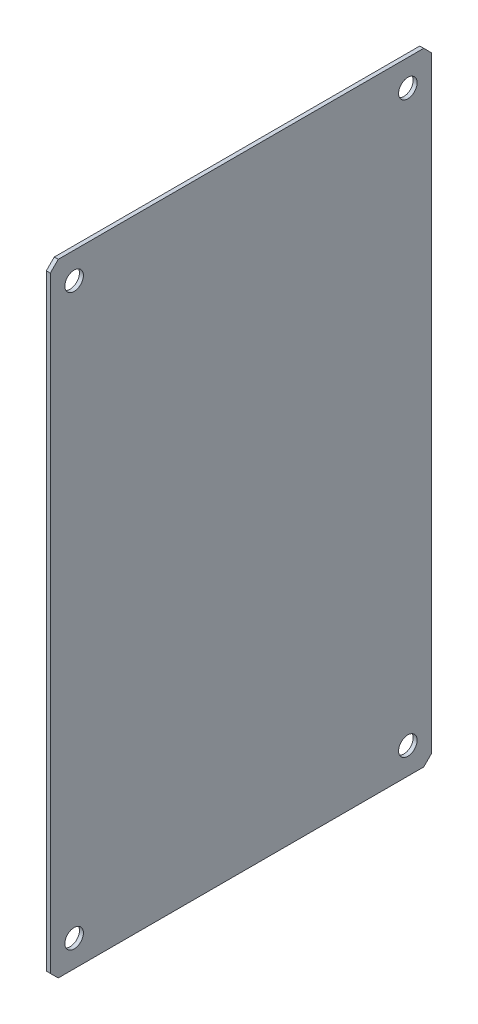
ISO-10303-21;
HEADER;
FILE_DESCRIPTION(('STEP AP214'),'2;1');
FILE_NAME('part.step','',(''),(''),'','','');
FILE_SCHEMA(('AUTOMOTIVE_DESIGN { 1 0 10303 214 1 1 1 1 }'));
ENDSEC;
DATA;
#1=APPLICATION_CONTEXT('core data for automotive mechanical design processes');
#2=APPLICATION_PROTOCOL_DEFINITION('international standard','automotive_design',2000,#1);
#3=PRODUCT_CONTEXT('',#1,'mechanical');
#4=PRODUCT('Part','Part','',(#3));
#5=PRODUCT_RELATED_PRODUCT_CATEGORY('part','',(#4));
#6=PRODUCT_DEFINITION_FORMATION('','',#4);
#7=PRODUCT_DEFINITION_CONTEXT('part definition',#1,'design');
#8=PRODUCT_DEFINITION('design','',#6,#7);
#9=PRODUCT_DEFINITION_SHAPE('','',#8);
#10=(LENGTH_UNIT() NAMED_UNIT(*) SI_UNIT(.MILLI.,.METRE.));
#11=(NAMED_UNIT(*) PLANE_ANGLE_UNIT() SI_UNIT($,.RADIAN.));
#12=(NAMED_UNIT(*) SI_UNIT($,.STERADIAN.) SOLID_ANGLE_UNIT());
#13=UNCERTAINTY_MEASURE_WITH_UNIT(LENGTH_MEASURE(1.E-05),#10,'distance_accuracy_value','');
#14=(GEOMETRIC_REPRESENTATION_CONTEXT(3) GLOBAL_UNCERTAINTY_ASSIGNED_CONTEXT((#13)) GLOBAL_UNIT_ASSIGNED_CONTEXT((#10,
#11,#12)) REPRESENTATION_CONTEXT('',''));
#15=CARTESIAN_POINT('',(0.,0.,0.));
#16=DIRECTION('',(0.,0.,1.));
#17=DIRECTION('',(1.,0.,0.));
#18=AXIS2_PLACEMENT_3D('',#15,#16,#17);
#19=CARTESIAN_POINT('',(1.49999999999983,-117.5,72.));
#20=DIRECTION('',(0.,0.,-1.));
#21=DIRECTION('',(0.,1.,0.));
#22=AXIS2_PLACEMENT_3D('',#19,#20,#21);
#23=PLANE('',#22);
#24=DIRECTION('',(0.,-1.,0.));
#25=VECTOR('',#24,1.);
#26=CARTESIAN_POINT('',(1.49999999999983,-117.5,72.));
#27=LINE('',#26,#25);
#28=CARTESIAN_POINT('',(1.49999999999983,114.5,72.));
#29=VERTEX_POINT('',#28);
#30=CARTESIAN_POINT('',(1.49999999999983,-114.5,72.));
#31=VERTEX_POINT('',#30);
#32=EDGE_CURVE('E99',#29,#31,#27,.T.);
#33=ORIENTED_EDGE('',*,*,#32,.F.);
#34=DIRECTION('',(-1.,0.,0.));
#35=VECTOR('',#34,1.);
#36=CARTESIAN_POINT('',(1.49999999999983,114.5,72.));
#37=LINE('',#36,#35);
#38=CARTESIAN_POINT('',(0.,114.5,72.));
#39=VERTEX_POINT('',#38);
#40=EDGE_CURVE('E84',#29,#39,#37,.T.);
#41=ORIENTED_EDGE('',*,*,#40,.T.);
#42=DIRECTION('',(0.,-1.,0.));
#43=VECTOR('',#42,1.);
#44=CARTESIAN_POINT('',(0.,-117.5,72.));
#45=LINE('',#44,#43);
#46=CARTESIAN_POINT('',(0.,-114.5,72.));
#47=VERTEX_POINT('',#46);
#48=EDGE_CURVE('E96',#39,#47,#45,.T.);
#49=ORIENTED_EDGE('',*,*,#48,.T.);
#50=DIRECTION('',(1.,0.,0.));
#51=VECTOR('',#50,1.);
#52=CARTESIAN_POINT('',(1.49999999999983,-114.5,72.));
#53=LINE('',#52,#51);
#54=EDGE_CURVE('E101',#47,#31,#53,.T.);
#55=ORIENTED_EDGE('',*,*,#54,.T.);
#56=EDGE_LOOP('',(#33,#41,#49,#55));
#57=FACE_BOUND('',#56,.T.);
#58=ADVANCED_FACE('F15',(#57),#23,.F.);
#59=CARTESIAN_POINT('',(1.49999999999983,-117.5,72.));
#60=DIRECTION('',(0.,1.,0.));
#61=DIRECTION('',(0.,0.,1.));
#62=AXIS2_PLACEMENT_3D('',#59,#60,#61);
#63=PLANE('',#62);
#64=DIRECTION('',(0.,0.,-1.));
#65=VECTOR('',#64,1.);
#66=CARTESIAN_POINT('',(0.,-117.5,72.));
#67=LINE('',#66,#65);
#68=CARTESIAN_POINT('',(0.,-117.5,69.));
#69=VERTEX_POINT('',#68);
#70=CARTESIAN_POINT('',(0.,-117.5,-69.));
#71=VERTEX_POINT('',#70);
#72=EDGE_CURVE('E105',#69,#71,#67,.T.);
#73=ORIENTED_EDGE('',*,*,#72,.T.);
#74=DIRECTION('',(1.,0.,0.));
#75=VECTOR('',#74,1.);
#76=CARTESIAN_POINT('',(1.49999999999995,-117.5,-69.));
#77=LINE('',#76,#75);
#78=CARTESIAN_POINT('',(1.49999999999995,-117.5,-69.));
#79=VERTEX_POINT('',#78);
#80=EDGE_CURVE('E10',#71,#79,#77,.T.);
#81=ORIENTED_EDGE('',*,*,#80,.T.);
#82=DIRECTION('',(0.,0.,-1.));
#83=VECTOR('',#82,1.);
#84=CARTESIAN_POINT('',(1.49999999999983,-117.5,72.));
#85=LINE('',#84,#83);
#86=CARTESIAN_POINT('',(1.49999999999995,-117.5,69.));
#87=VERTEX_POINT('',#86);
#88=EDGE_CURVE('E120',#87,#79,#85,.T.);
#89=ORIENTED_EDGE('',*,*,#88,.F.);
#90=DIRECTION('',(-1.,0.,0.));
#91=VECTOR('',#90,1.);
#92=CARTESIAN_POINT('',(1.49999999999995,-117.5,69.));
#93=LINE('',#92,#91);
#94=EDGE_CURVE('E22',#87,#69,#93,.T.);
#95=ORIENTED_EDGE('',*,*,#94,.T.);
#96=EDGE_LOOP('',(#73,#81,#89,#95));
#97=FACE_BOUND('',#96,.T.);
#98=ADVANCED_FACE('F149',(#97),#63,.F.);
#99=CARTESIAN_POINT('',(1.49999999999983,-117.5,-72.));
#100=DIRECTION('',(0.,0.,1.));
#101=DIRECTION('',(0.,-1.,0.));
#102=AXIS2_PLACEMENT_3D('',#99,#100,#101);
#103=PLANE('',#102);
#104=DIRECTION('',(0.,1.,0.));
#105=VECTOR('',#104,1.);
#106=CARTESIAN_POINT('',(0.,-117.5,-72.));
#107=LINE('',#106,#105);
#108=CARTESIAN_POINT('',(0.,-114.5,-72.));
#109=VERTEX_POINT('',#108);
#110=CARTESIAN_POINT('',(0.,114.5,-72.));
#111=VERTEX_POINT('',#110);
#112=EDGE_CURVE('E109',#109,#111,#107,.T.);
#113=ORIENTED_EDGE('',*,*,#112,.T.);
#114=DIRECTION('',(1.,0.,0.));
#115=VECTOR('',#114,1.);
#116=CARTESIAN_POINT('',(1.49999999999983,114.5,-72.));
#117=LINE('',#116,#115);
#118=CARTESIAN_POINT('',(1.49999999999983,114.5,-72.));
#119=VERTEX_POINT('',#118);
#120=EDGE_CURVE('E29',#111,#119,#117,.T.);
#121=ORIENTED_EDGE('',*,*,#120,.T.);
#122=DIRECTION('',(0.,1.,0.));
#123=VECTOR('',#122,1.);
#124=CARTESIAN_POINT('',(1.49999999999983,-117.5,-72.));
#125=LINE('',#124,#123);
#126=CARTESIAN_POINT('',(1.49999999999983,-114.5,-72.));
#127=VERTEX_POINT('',#126);
#128=EDGE_CURVE('E122',#127,#119,#125,.T.);
#129=ORIENTED_EDGE('',*,*,#128,.F.);
#130=DIRECTION('',(-1.,0.,0.));
#131=VECTOR('',#130,1.);
#132=CARTESIAN_POINT('',(1.49999999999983,-114.5,-72.));
#133=LINE('',#132,#131);
#134=EDGE_CURVE('E142',#127,#109,#133,.T.);
#135=ORIENTED_EDGE('',*,*,#134,.T.);
#136=EDGE_LOOP('',(#113,#121,#129,#135));
#137=FACE_BOUND('',#136,.T.);
#138=ADVANCED_FACE('F157',(#137),#103,.F.);
#139=CARTESIAN_POINT('',(1.49999999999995,117.5,72.));
#140=DIRECTION('',(0.,-1.,0.));
#141=DIRECTION('',(0.,0.,-1.));
#142=AXIS2_PLACEMENT_3D('',#139,#140,#141);
#143=PLANE('',#142);
#144=DIRECTION('',(0.,0.,1.));
#145=VECTOR('',#144,1.);
#146=CARTESIAN_POINT('',(0.,117.5,72.));
#147=LINE('',#146,#145);
#148=CARTESIAN_POINT('',(0.,117.5,-69.));
#149=VERTEX_POINT('',#148);
#150=CARTESIAN_POINT('',(0.,117.5,69.));
#151=VERTEX_POINT('',#150);
#152=EDGE_CURVE('E117',#149,#151,#147,.T.);
#153=ORIENTED_EDGE('',*,*,#152,.T.);
#154=DIRECTION('',(1.,0.,0.));
#155=VECTOR('',#154,1.);
#156=CARTESIAN_POINT('',(1.49999999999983,117.5,69.));
#157=LINE('',#156,#155);
#158=CARTESIAN_POINT('',(1.49999999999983,117.5,69.));
#159=VERTEX_POINT('',#158);
#160=EDGE_CURVE('E85',#151,#159,#157,.T.);
#161=ORIENTED_EDGE('',*,*,#160,.T.);
#162=DIRECTION('',(0.,0.,1.));
#163=VECTOR('',#162,1.);
#164=CARTESIAN_POINT('',(1.49999999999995,117.5,72.));
#165=LINE('',#164,#163);
#166=CARTESIAN_POINT('',(1.49999999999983,117.5,-69.));
#167=VERTEX_POINT('',#166);
#168=EDGE_CURVE('E124',#167,#159,#165,.T.);
#169=ORIENTED_EDGE('',*,*,#168,.F.);
#170=DIRECTION('',(-1.,0.,0.));
#171=VECTOR('',#170,1.);
#172=CARTESIAN_POINT('',(1.49999999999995,117.5,-69.));
#173=LINE('',#172,#171);
#174=EDGE_CURVE('E90',#167,#149,#173,.T.);
#175=ORIENTED_EDGE('',*,*,#174,.T.);
#176=EDGE_LOOP('',(#153,#161,#169,#175));
#177=FACE_BOUND('',#176,.T.);
#178=ADVANCED_FACE('F165',(#177),#143,.F.);
#179=CARTESIAN_POINT('',(1.49999999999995,117.5,72.));
#180=DIRECTION('',(-1.,0.,0.));
#181=DIRECTION('',(0.,0.,1.));
#182=AXIS2_PLACEMENT_3D('',#179,#180,#181);
#183=PLANE('',#182);
#184=CARTESIAN_POINT('',(1.49999999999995,107.5,-63.));
#185=DIRECTION('',(-1.,0.,0.));
#186=DIRECTION('',(0.,0.,1.));
#187=AXIS2_PLACEMENT_3D('',#184,#185,#186);
#188=CIRCLE('',#187,3.5);
#189=CARTESIAN_POINT('',(1.49999999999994,107.5,-59.5));
#190=VERTEX_POINT('',#189);
#191=EDGE_CURVE('E268',#190,#190,#188,.T.);
#192=ORIENTED_EDGE('',*,*,#191,.T.);
#193=EDGE_LOOP('',(#192));
#194=FACE_BOUND('',#193,.T.);
#195=CARTESIAN_POINT('',(1.49999999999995,-107.5,-63.));
#196=DIRECTION('',(-1.,0.,0.));
#197=DIRECTION('',(0.,0.,1.));
#198=AXIS2_PLACEMENT_3D('',#195,#196,#197);
#199=CIRCLE('',#198,3.5);
#200=CARTESIAN_POINT('',(1.49999999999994,-107.5,-59.5));
#201=VERTEX_POINT('',#200);
#202=EDGE_CURVE('E278',#201,#201,#199,.T.);
#203=ORIENTED_EDGE('',*,*,#202,.T.);
#204=EDGE_LOOP('',(#203));
#205=FACE_BOUND('',#204,.T.);
#206=CARTESIAN_POINT('',(1.49999999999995,-107.5,63.));
#207=DIRECTION('',(-1.,0.,0.));
#208=DIRECTION('',(0.,0.,1.));
#209=AXIS2_PLACEMENT_3D('',#206,#207,#208);
#210=CIRCLE('',#209,3.5);
#211=CARTESIAN_POINT('',(1.49999999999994,-107.5,66.5));
#212=VERTEX_POINT('',#211);
#213=EDGE_CURVE('E284',#212,#212,#210,.T.);
#214=ORIENTED_EDGE('',*,*,#213,.T.);
#215=EDGE_LOOP('',(#214));
#216=FACE_BOUND('',#215,.T.);
#217=CARTESIAN_POINT('',(1.49999999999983,107.5,63.));
#218=DIRECTION('',(-1.,0.,0.));
#219=DIRECTION('',(0.,0.,1.));
#220=AXIS2_PLACEMENT_3D('',#217,#218,#219);
#221=CIRCLE('',#220,3.5);
#222=CARTESIAN_POINT('',(1.49999999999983,107.5,66.5));
#223=VERTEX_POINT('',#222);
#224=EDGE_CURVE('E106',#223,#223,#221,.T.);
#225=ORIENTED_EDGE('',*,*,#224,.T.);
#226=EDGE_LOOP('',(#225));
#227=FACE_BOUND('',#226,.T.);
#228=ORIENTED_EDGE('',*,*,#168,.T.);
#229=DIRECTION('',(0.,0.707106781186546,-0.707106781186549));
#230=VECTOR('',#229,1.);
#231=CARTESIAN_POINT('',(1.49999999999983,114.5,72.));
#232=LINE('',#231,#230);
#233=EDGE_CURVE('E140',#159,#29,#232,.F.);
#234=ORIENTED_EDGE('',*,*,#233,.T.);
#235=ORIENTED_EDGE('',*,*,#32,.T.);
#236=DIRECTION('',(0.,0.707106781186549,0.707106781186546));
#237=VECTOR('',#236,1.);
#238=CARTESIAN_POINT('',(1.49999999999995,-117.5,69.));
#239=LINE('',#238,#237);
#240=EDGE_CURVE('E135',#31,#87,#239,.F.);
#241=ORIENTED_EDGE('',*,*,#240,.T.);
#242=ORIENTED_EDGE('',*,*,#88,.T.);
#243=DIRECTION('',(0.,-0.707106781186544,0.707106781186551));
#244=VECTOR('',#243,1.);
#245=CARTESIAN_POINT('',(1.49999999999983,-114.5,-72.));
#246=LINE('',#245,#244);
#247=EDGE_CURVE('E36',#79,#127,#246,.F.);
#248=ORIENTED_EDGE('',*,*,#247,.T.);
#249=ORIENTED_EDGE('',*,*,#128,.T.);
#250=DIRECTION('',(0.,-0.707106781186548,-0.707106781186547));
#251=VECTOR('',#250,1.);
#252=CARTESIAN_POINT('',(1.49999999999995,117.5,-69.));
#253=LINE('',#252,#251);
#254=EDGE_CURVE('E138',#119,#167,#253,.F.);
#255=ORIENTED_EDGE('',*,*,#254,.T.);
#256=EDGE_LOOP('',(#228,#234,#235,#241,#242,#248,#249,#255));
#257=FACE_BOUND('',#256,.T.);
#258=ADVANCED_FACE('F159',(#194,#205,#216,#227,#257),#183,.F.);
#259=CARTESIAN_POINT('',(0.,117.5,72.));
#260=DIRECTION('',(-1.,0.,0.));
#261=DIRECTION('',(0.,0.,1.));
#262=AXIS2_PLACEMENT_3D('',#259,#260,#261);
#263=PLANE('',#262);
#264=CARTESIAN_POINT('',(0.,107.5,-63.));
#265=DIRECTION('',(-1.,0.,0.));
#266=DIRECTION('',(0.,0.,1.));
#267=AXIS2_PLACEMENT_3D('',#264,#265,#266);
#268=CIRCLE('',#267,3.5);
#269=CARTESIAN_POINT('',(0.,107.5,-59.5));
#270=VERTEX_POINT('',#269);
#271=EDGE_CURVE('E271',#270,#270,#268,.T.);
#272=ORIENTED_EDGE('',*,*,#271,.F.);
#273=EDGE_LOOP('',(#272));
#274=FACE_BOUND('',#273,.T.);
#275=CARTESIAN_POINT('',(0.,-107.5,-63.));
#276=DIRECTION('',(-1.,0.,0.));
#277=DIRECTION('',(0.,0.,1.));
#278=AXIS2_PLACEMENT_3D('',#275,#276,#277);
#279=CIRCLE('',#278,3.5);
#280=CARTESIAN_POINT('',(0.,-107.5,-59.5));
#281=VERTEX_POINT('',#280);
#282=EDGE_CURVE('E273',#281,#281,#279,.T.);
#283=ORIENTED_EDGE('',*,*,#282,.F.);
#284=EDGE_LOOP('',(#283));
#285=FACE_BOUND('',#284,.T.);
#286=CARTESIAN_POINT('',(0.,-107.5,63.));
#287=DIRECTION('',(-1.,0.,0.));
#288=DIRECTION('',(0.,0.,1.));
#289=AXIS2_PLACEMENT_3D('',#286,#287,#288);
#290=CIRCLE('',#289,3.5);
#291=CARTESIAN_POINT('',(0.,-107.5,66.5));
#292=VERTEX_POINT('',#291);
#293=EDGE_CURVE('E281',#292,#292,#290,.T.);
#294=ORIENTED_EDGE('',*,*,#293,.F.);
#295=EDGE_LOOP('',(#294));
#296=FACE_BOUND('',#295,.T.);
#297=CARTESIAN_POINT('',(0.,107.5,63.));
#298=DIRECTION('',(-1.,0.,0.));
#299=DIRECTION('',(0.,0.,1.));
#300=AXIS2_PLACEMENT_3D('',#297,#298,#299);
#301=CIRCLE('',#300,3.5);
#302=CARTESIAN_POINT('',(0.,107.5,66.5));
#303=VERTEX_POINT('',#302);
#304=EDGE_CURVE('E112',#303,#303,#301,.T.);
#305=ORIENTED_EDGE('',*,*,#304,.F.);
#306=EDGE_LOOP('',(#305));
#307=FACE_BOUND('',#306,.T.);
#308=ORIENTED_EDGE('',*,*,#48,.F.);
#309=DIRECTION('',(0.,-0.707106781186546,0.707106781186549));
#310=VECTOR('',#309,1.);
#311=CARTESIAN_POINT('',(0.,116.,70.5));
#312=LINE('',#311,#310);
#313=EDGE_CURVE('E80',#39,#151,#312,.F.);
#314=ORIENTED_EDGE('',*,*,#313,.T.);
#315=ORIENTED_EDGE('',*,*,#152,.F.);
#316=DIRECTION('',(0.,0.707106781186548,0.707106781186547));
#317=VECTOR('',#316,1.);
#318=CARTESIAN_POINT('',(0.,188.,1.5));
#319=LINE('',#318,#317);
#320=EDGE_CURVE('E91',#149,#111,#319,.F.);
#321=ORIENTED_EDGE('',*,*,#320,.T.);
#322=ORIENTED_EDGE('',*,*,#112,.F.);
#323=DIRECTION('',(0.,0.707106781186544,-0.707106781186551));
#324=VECTOR('',#323,1.);
#325=CARTESIAN_POINT('',(0.,-70.5000000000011,-116.));
#326=LINE('',#325,#324);
#327=EDGE_CURVE('E129',#109,#71,#326,.F.);
#328=ORIENTED_EDGE('',*,*,#327,.T.);
#329=ORIENTED_EDGE('',*,*,#72,.F.);
#330=DIRECTION('',(0.,-0.707106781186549,-0.707106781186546));
#331=VECTOR('',#330,1.);
#332=CARTESIAN_POINT('',(-2.22044604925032E-13,1.50000000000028,188.));
#333=LINE('',#332,#331);
#334=EDGE_CURVE('E100',#69,#47,#333,.F.);
#335=ORIENTED_EDGE('',*,*,#334,.T.);
#336=EDGE_LOOP('',(#308,#314,#315,#321,#322,#328,#329,#335));
#337=FACE_BOUND('',#336,.T.);
#338=ADVANCED_FACE('F103',(#274,#285,#296,#307,#337),#263,.T.);
#339=CARTESIAN_POINT('',(0.,107.5,63.));
#340=DIRECTION('',(-1.,0.,0.));
#341=DIRECTION('',(0.,0.,1.));
#342=AXIS2_PLACEMENT_3D('',#339,#340,#341);
#343=CYLINDRICAL_SURFACE('',#342,3.5);
#344=ORIENTED_EDGE('',*,*,#224,.F.);
#345=EDGE_LOOP('',(#344));
#346=FACE_BOUND('',#345,.T.);
#347=ORIENTED_EDGE('',*,*,#304,.T.);
#348=EDGE_LOOP('',(#347));
#349=FACE_BOUND('',#348,.T.);
#350=ADVANCED_FACE('F190',(#346,#349),#343,.F.);
#351=CARTESIAN_POINT('',(0.,-107.5,63.));
#352=DIRECTION('',(-1.,0.,0.));
#353=DIRECTION('',(0.,0.,1.));
#354=AXIS2_PLACEMENT_3D('',#351,#352,#353);
#355=CYLINDRICAL_SURFACE('',#354,3.5);
#356=ORIENTED_EDGE('',*,*,#213,.F.);
#357=EDGE_LOOP('',(#356));
#358=FACE_BOUND('',#357,.T.);
#359=ORIENTED_EDGE('',*,*,#293,.T.);
#360=EDGE_LOOP('',(#359));
#361=FACE_BOUND('',#360,.T.);
#362=ADVANCED_FACE('F194',(#358,#361),#355,.F.);
#363=CARTESIAN_POINT('',(0.,-107.5,-63.));
#364=DIRECTION('',(-1.,0.,0.));
#365=DIRECTION('',(0.,0.,1.));
#366=AXIS2_PLACEMENT_3D('',#363,#364,#365);
#367=CYLINDRICAL_SURFACE('',#366,3.5);
#368=ORIENTED_EDGE('',*,*,#202,.F.);
#369=EDGE_LOOP('',(#368));
#370=FACE_BOUND('',#369,.T.);
#371=ORIENTED_EDGE('',*,*,#282,.T.);
#372=EDGE_LOOP('',(#371));
#373=FACE_BOUND('',#372,.T.);
#374=ADVANCED_FACE('F198',(#370,#373),#367,.F.);
#375=CARTESIAN_POINT('',(0.,107.5,-63.));
#376=DIRECTION('',(-1.,0.,0.));
#377=DIRECTION('',(0.,0.,1.));
#378=AXIS2_PLACEMENT_3D('',#375,#376,#377);
#379=CYLINDRICAL_SURFACE('',#378,3.5);
#380=ORIENTED_EDGE('',*,*,#191,.F.);
#381=EDGE_LOOP('',(#380));
#382=FACE_BOUND('',#381,.T.);
#383=ORIENTED_EDGE('',*,*,#271,.T.);
#384=EDGE_LOOP('',(#383));
#385=FACE_BOUND('',#384,.T.);
#386=ADVANCED_FACE('F202',(#382,#385),#379,.F.);
#387=CARTESIAN_POINT('',(1.49999999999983,114.5,72.));
#388=DIRECTION('',(0.,-0.707106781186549,-0.707106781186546));
#389=DIRECTION('',(0.,0.707106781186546,-0.707106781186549));
#390=AXIS2_PLACEMENT_3D('',#387,#388,#389);
#391=PLANE('',#390);
#392=ORIENTED_EDGE('',*,*,#233,.F.);
#393=ORIENTED_EDGE('',*,*,#160,.F.);
#394=ORIENTED_EDGE('',*,*,#313,.F.);
#395=ORIENTED_EDGE('',*,*,#40,.F.);
#396=EDGE_LOOP('',(#392,#393,#394,#395));
#397=FACE_BOUND('',#396,.T.);
#398=ADVANCED_FACE('F83',(#397),#391,.F.);
#399=CARTESIAN_POINT('',(1.49999999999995,117.5,-69.));
#400=DIRECTION('',(0.,-0.707106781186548,0.707106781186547));
#401=DIRECTION('',(0.,-0.707106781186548,-0.707106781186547));
#402=AXIS2_PLACEMENT_3D('',#399,#400,#401);
#403=PLANE('',#402);
#404=ORIENTED_EDGE('',*,*,#254,.F.);
#405=ORIENTED_EDGE('',*,*,#120,.F.);
#406=ORIENTED_EDGE('',*,*,#320,.F.);
#407=ORIENTED_EDGE('',*,*,#174,.F.);
#408=EDGE_LOOP('',(#404,#405,#406,#407));
#409=FACE_BOUND('',#408,.T.);
#410=ADVANCED_FACE('F163',(#409),#403,.F.);
#411=CARTESIAN_POINT('',(1.49999999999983,-114.5,-72.));
#412=DIRECTION('',(0.,0.707106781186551,0.707106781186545));
#413=DIRECTION('',(0.,-0.707106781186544,0.707106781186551));
#414=AXIS2_PLACEMENT_3D('',#411,#412,#413);
#415=PLANE('',#414);
#416=ORIENTED_EDGE('',*,*,#247,.F.);
#417=ORIENTED_EDGE('',*,*,#80,.F.);
#418=ORIENTED_EDGE('',*,*,#327,.F.);
#419=ORIENTED_EDGE('',*,*,#134,.F.);
#420=EDGE_LOOP('',(#416,#417,#418,#419));
#421=FACE_BOUND('',#420,.T.);
#422=ADVANCED_FACE('F156',(#421),#415,.F.);
#423=CARTESIAN_POINT('',(1.49999999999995,-117.5,69.));
#424=DIRECTION('',(0.,0.707106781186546,-0.707106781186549));
#425=DIRECTION('',(0.,0.707106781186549,0.707106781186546));
#426=AXIS2_PLACEMENT_3D('',#423,#424,#425);
#427=PLANE('',#426);
#428=ORIENTED_EDGE('',*,*,#240,.F.);
#429=ORIENTED_EDGE('',*,*,#54,.F.);
#430=ORIENTED_EDGE('',*,*,#334,.F.);
#431=ORIENTED_EDGE('',*,*,#94,.F.);
#432=EDGE_LOOP('',(#428,#429,#430,#431));
#433=FACE_BOUND('',#432,.T.);
#434=ADVANCED_FACE('F166',(#433),#427,.F.);
#435=CLOSED_SHELL('',(#58,#98,#138,#178,#258,#338,#350,#362,#374,#386,#398,#410,#422,#434));
#436=MANIFOLD_SOLID_BREP('B1',#435);
#437=ADVANCED_BREP_SHAPE_REPRESENTATION('',(#18,#436),#14);
#438=SHAPE_DEFINITION_REPRESENTATION(#9,#437);
ENDSEC;
END-ISO-10303-21;
